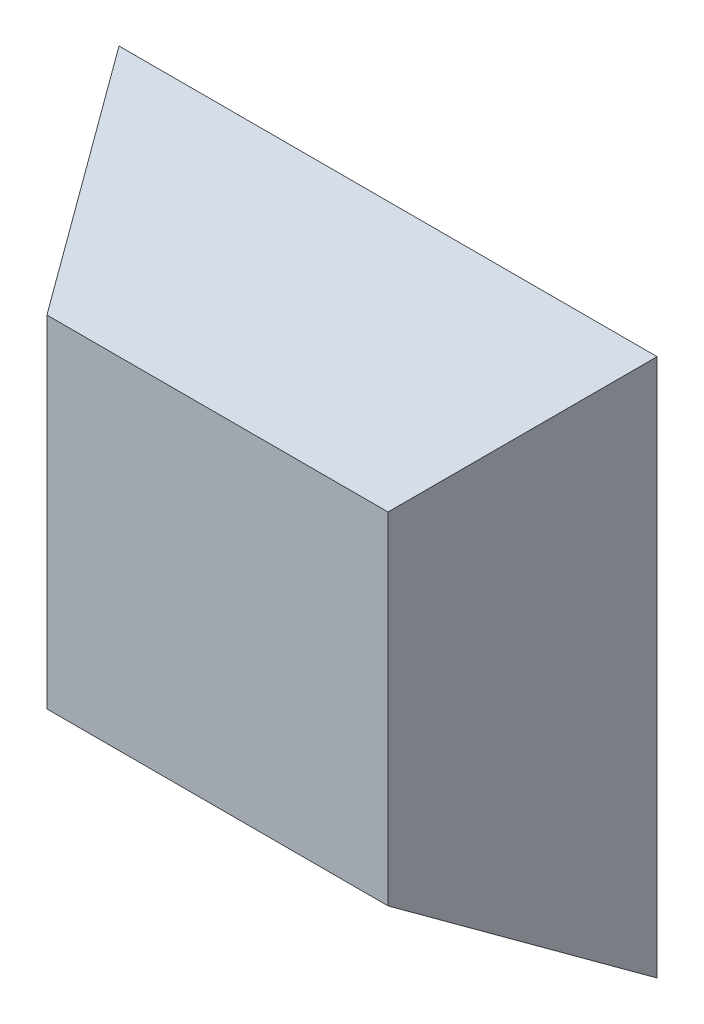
ISO-10303-21;
HEADER;
FILE_DESCRIPTION(('STEP AP214'),'2;1');
FILE_NAME('part.step','',(''),(''),'','','');
FILE_SCHEMA(('AUTOMOTIVE_DESIGN { 1 0 10303 214 1 1 1 1 }'));
ENDSEC;
DATA;
#1=APPLICATION_CONTEXT('core data for automotive mechanical design processes');
#2=APPLICATION_PROTOCOL_DEFINITION('international standard','automotive_design',2000,#1);
#3=PRODUCT_CONTEXT('',#1,'mechanical');
#4=PRODUCT('Part','Part','',(#3));
#5=PRODUCT_RELATED_PRODUCT_CATEGORY('part','',(#4));
#6=PRODUCT_DEFINITION_FORMATION('','',#4);
#7=PRODUCT_DEFINITION_CONTEXT('part definition',#1,'design');
#8=PRODUCT_DEFINITION('design','',#6,#7);
#9=PRODUCT_DEFINITION_SHAPE('','',#8);
#10=(LENGTH_UNIT() NAMED_UNIT(*) SI_UNIT(.MILLI.,.METRE.));
#11=(NAMED_UNIT(*) PLANE_ANGLE_UNIT() SI_UNIT($,.RADIAN.));
#12=(NAMED_UNIT(*) SI_UNIT($,.STERADIAN.) SOLID_ANGLE_UNIT());
#13=UNCERTAINTY_MEASURE_WITH_UNIT(LENGTH_MEASURE(1.E-05),#10,'distance_accuracy_value','');
#14=(GEOMETRIC_REPRESENTATION_CONTEXT(3) GLOBAL_UNCERTAINTY_ASSIGNED_CONTEXT((#13)) GLOBAL_UNIT_ASSIGNED_CONTEXT((#10,
#11,#12)) REPRESENTATION_CONTEXT('',''));
#15=CARTESIAN_POINT('',(0.,0.,0.));
#16=DIRECTION('',(0.,0.,1.));
#17=DIRECTION('',(1.,0.,0.));
#18=AXIS2_PLACEMENT_3D('',#15,#16,#17);
#19=CARTESIAN_POINT('',(-80.,80.,80.));
#20=DIRECTION('',(-0.866025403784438,0.,0.500000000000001));
#21=DIRECTION('',(0.500000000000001,0.,0.866025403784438));
#22=AXIS2_PLACEMENT_3D('',#19,#20,#21);
#23=PLANE('',#22);
#24=DIRECTION('',(0.,1.,0.));
#25=VECTOR('',#24,1.);
#26=CARTESIAN_POINT('',(-126.18802153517,80.,0.));
#27=LINE('',#26,#25);
#28=CARTESIAN_POINT('',(-126.18802153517,126.18802153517,0.));
#29=VERTEX_POINT('',#28);
#30=CARTESIAN_POINT('',(-126.18802153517,-126.18802153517,0.));
#31=VERTEX_POINT('',#30);
#32=EDGE_CURVE('E405',#29,#31,#27,.F.);
#33=ORIENTED_EDGE('',*,*,#32,.T.);
#34=DIRECTION('',(-0.447213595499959,-0.447213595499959,-0.774596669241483));
#35=VECTOR('',#34,1.);
#36=CARTESIAN_POINT('',(-80.,-80.,80.));
#37=LINE('',#36,#35);
#38=CARTESIAN_POINT('',(-80.,-80.,80.));
#39=VERTEX_POINT('',#38);
#40=EDGE_CURVE('E11',#39,#31,#37,.T.);
#41=ORIENTED_EDGE('',*,*,#40,.F.);
#42=DIRECTION('',(0.,-1.,0.));
#43=VECTOR('',#42,1.);
#44=CARTESIAN_POINT('',(-80.,80.,80.));
#45=LINE('',#44,#43);
#46=CARTESIAN_POINT('',(-80.,80.,80.));
#47=VERTEX_POINT('',#46);
#48=EDGE_CURVE('E416',#47,#39,#45,.T.);
#49=ORIENTED_EDGE('',*,*,#48,.F.);
#50=DIRECTION('',(-0.447213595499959,0.447213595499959,-0.774596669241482));
#51=VECTOR('',#50,1.);
#52=CARTESIAN_POINT('',(-80.,80.,80.));
#53=LINE('',#52,#51);
#54=EDGE_CURVE('E425',#47,#29,#53,.T.);
#55=ORIENTED_EDGE('',*,*,#54,.T.);
#56=EDGE_LOOP('',(#33,#41,#49,#55));
#57=FACE_BOUND('',#56,.T.);
#58=ADVANCED_FACE('F349',(#57),#23,.T.);
#59=CARTESIAN_POINT('',(-80.,-80.,80.));
#60=DIRECTION('',(0.,-0.866025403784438,0.500000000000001));
#61=DIRECTION('',(0.,-0.500000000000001,-0.866025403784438));
#62=AXIS2_PLACEMENT_3D('',#59,#60,#61);
#63=PLANE('',#62);
#64=DIRECTION('',(-1.,0.,0.));
#65=VECTOR('',#64,1.);
#66=CARTESIAN_POINT('',(-80.,-126.18802153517,0.));
#67=LINE('',#66,#65);
#68=CARTESIAN_POINT('',(126.18802153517,-126.18802153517,0.));
#69=VERTEX_POINT('',#68);
#70=EDGE_CURVE('E395',#31,#69,#67,.F.);
#71=ORIENTED_EDGE('',*,*,#70,.T.);
#72=DIRECTION('',(0.447213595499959,-0.447213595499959,-0.774596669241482));
#73=VECTOR('',#72,1.);
#74=CARTESIAN_POINT('',(47.9999999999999,-47.9999999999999,135.425625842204));
#75=LINE('',#74,#73);
#76=CARTESIAN_POINT('',(80.,-80.,80.));
#77=VERTEX_POINT('',#76);
#78=EDGE_CURVE('E358',#77,#69,#75,.T.);
#79=ORIENTED_EDGE('',*,*,#78,.F.);
#80=DIRECTION('',(1.,0.,0.));
#81=VECTOR('',#80,1.);
#82=CARTESIAN_POINT('',(-80.,-80.,80.));
#83=LINE('',#82,#81);
#84=EDGE_CURVE('E419',#39,#77,#83,.T.);
#85=ORIENTED_EDGE('',*,*,#84,.F.);
#86=ORIENTED_EDGE('',*,*,#40,.T.);
#87=EDGE_LOOP('',(#71,#79,#85,#86));
#88=FACE_BOUND('',#87,.T.);
#89=ADVANCED_FACE('F397',(#88),#63,.T.);
#90=CARTESIAN_POINT('',(80.,80.,80.));
#91=DIRECTION('',(0.866025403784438,0.,0.500000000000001));
#92=DIRECTION('',(0.500000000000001,0.,-0.866025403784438));
#93=AXIS2_PLACEMENT_3D('',#90,#91,#92);
#94=PLANE('',#93);
#95=DIRECTION('',(0.,-1.,0.));
#96=VECTOR('',#95,1.);
#97=CARTESIAN_POINT('',(126.18802153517,80.,0.));
#98=LINE('',#97,#96);
#99=CARTESIAN_POINT('',(126.18802153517,126.18802153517,0.));
#100=VERTEX_POINT('',#99);
#101=EDGE_CURVE('E353',#69,#100,#98,.F.);
#102=ORIENTED_EDGE('',*,*,#101,.T.);
#103=DIRECTION('',(0.447213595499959,0.447213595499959,-0.774596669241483));
#104=VECTOR('',#103,1.);
#105=CARTESIAN_POINT('',(47.9999999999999,47.9999999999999,135.425625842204));
#106=LINE('',#105,#104);
#107=CARTESIAN_POINT('',(80.,80.,80.));
#108=VERTEX_POINT('',#107);
#109=EDGE_CURVE('E411',#108,#100,#106,.T.);
#110=ORIENTED_EDGE('',*,*,#109,.F.);
#111=DIRECTION('',(0.,1.,0.));
#112=VECTOR('',#111,1.);
#113=CARTESIAN_POINT('',(80.,80.,80.));
#114=LINE('',#113,#112);
#115=EDGE_CURVE('E410',#77,#108,#114,.T.);
#116=ORIENTED_EDGE('',*,*,#115,.F.);
#117=ORIENTED_EDGE('',*,*,#78,.T.);
#118=EDGE_LOOP('',(#102,#110,#116,#117));
#119=FACE_BOUND('',#118,.T.);
#120=ADVANCED_FACE('F351',(#119),#94,.T.);
#121=CARTESIAN_POINT('',(-80.,80.,80.));
#122=DIRECTION('',(0.,0.866025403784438,0.500000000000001));
#123=DIRECTION('',(0.,-0.500000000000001,0.866025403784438));
#124=AXIS2_PLACEMENT_3D('',#121,#122,#123);
#125=PLANE('',#124);
#126=DIRECTION('',(1.,0.,0.));
#127=VECTOR('',#126,1.);
#128=CARTESIAN_POINT('',(-80.,126.18802153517,0.));
#129=LINE('',#128,#127);
#130=EDGE_CURVE('E415',#100,#29,#129,.F.);
#131=ORIENTED_EDGE('',*,*,#130,.T.);
#132=ORIENTED_EDGE('',*,*,#54,.F.);
#133=DIRECTION('',(-1.,0.,0.));
#134=VECTOR('',#133,1.);
#135=CARTESIAN_POINT('',(-80.,80.,80.));
#136=LINE('',#135,#134);
#137=EDGE_CURVE('E375',#108,#47,#136,.T.);
#138=ORIENTED_EDGE('',*,*,#137,.F.);
#139=ORIENTED_EDGE('',*,*,#109,.T.);
#140=EDGE_LOOP('',(#131,#132,#138,#139));
#141=FACE_BOUND('',#140,.T.);
#142=ADVANCED_FACE('F488',(#141),#125,.T.);
#143=CARTESIAN_POINT('',(-80.,-80.,80.));
#144=DIRECTION('',(0.,0.,1.));
#145=DIRECTION('',(1.,0.,0.));
#146=AXIS2_PLACEMENT_3D('',#143,#144,#145);
#147=PLANE('',#146);
#148=ORIENTED_EDGE('',*,*,#48,.T.);
#149=ORIENTED_EDGE('',*,*,#84,.T.);
#150=ORIENTED_EDGE('',*,*,#115,.T.);
#151=ORIENTED_EDGE('',*,*,#137,.T.);
#152=EDGE_LOOP('',(#148,#149,#150,#151));
#153=FACE_BOUND('',#152,.T.);
#154=ADVANCED_FACE('F485',(#153),#147,.T.);
#155=CARTESIAN_POINT('',(-80.,-80.,0.));
#156=DIRECTION('',(0.,0.,1.));
#157=DIRECTION('',(1.,0.,0.));
#158=AXIS2_PLACEMENT_3D('',#155,#156,#157);
#159=PLANE('',#158);
#160=DIRECTION('',(1.,0.,0.));
#161=VECTOR('',#160,1.);
#162=CARTESIAN_POINT('',(-80.,124.455970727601,0.));
#163=LINE('',#162,#161);
#164=CARTESIAN_POINT('',(124.455970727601,124.455970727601,0.));
#165=VERTEX_POINT('',#164);
#166=CARTESIAN_POINT('',(-124.455970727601,124.455970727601,0.));
#167=VERTEX_POINT('',#166);
#168=EDGE_CURVE('E436',#165,#167,#163,.F.);
#169=ORIENTED_EDGE('',*,*,#168,.T.);
#170=DIRECTION('',(0.,1.,0.));
#171=VECTOR('',#170,1.);
#172=CARTESIAN_POINT('',(-124.455970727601,80.,0.));
#173=LINE('',#172,#171);
#174=CARTESIAN_POINT('',(-124.455970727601,-124.455970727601,0.));
#175=VERTEX_POINT('',#174);
#176=EDGE_CURVE('E434',#167,#175,#173,.F.);
#177=ORIENTED_EDGE('',*,*,#176,.T.);
#178=DIRECTION('',(-1.,0.,0.));
#179=VECTOR('',#178,1.);
#180=CARTESIAN_POINT('',(-80.,-124.455970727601,0.));
#181=LINE('',#180,#179);
#182=CARTESIAN_POINT('',(124.455970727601,-124.455970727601,0.));
#183=VERTEX_POINT('',#182);
#184=EDGE_CURVE('E431',#175,#183,#181,.F.);
#185=ORIENTED_EDGE('',*,*,#184,.T.);
#186=DIRECTION('',(0.,-1.,0.));
#187=VECTOR('',#186,1.);
#188=CARTESIAN_POINT('',(124.455970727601,80.,0.));
#189=LINE('',#188,#187);
#190=EDGE_CURVE('E366',#183,#165,#189,.F.);
#191=ORIENTED_EDGE('',*,*,#190,.T.);
#192=EDGE_LOOP('',(#169,#177,#185,#191));
#193=FACE_BOUND('',#192,.T.);
#194=ORIENTED_EDGE('',*,*,#32,.F.);
#195=ORIENTED_EDGE('',*,*,#130,.F.);
#196=ORIENTED_EDGE('',*,*,#101,.F.);
#197=ORIENTED_EDGE('',*,*,#70,.F.);
#198=EDGE_LOOP('',(#194,#195,#196,#197));
#199=FACE_BOUND('',#198,.T.);
#200=ADVANCED_FACE('F414',(#193,#199),#159,.F.);
#201=CARTESIAN_POINT('',(-78.7009618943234,80.,79.25));
#202=DIRECTION('',(-0.866025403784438,0.,0.500000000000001));
#203=DIRECTION('',(0.500000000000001,0.,0.866025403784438));
#204=AXIS2_PLACEMENT_3D('',#201,#202,#203);
#205=PLANE('',#204);
#206=ORIENTED_EDGE('',*,*,#176,.F.);
#207=DIRECTION('',(-0.447213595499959,0.447213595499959,-0.774596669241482));
#208=VECTOR('',#207,1.);
#209=CARTESIAN_POINT('',(-78.9607695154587,78.9607695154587,78.8));
#210=LINE('',#209,#208);
#211=CARTESIAN_POINT('',(-79.1339745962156,79.1339745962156,78.5));
#212=VERTEX_POINT('',#211);
#213=EDGE_CURVE('E445',#212,#167,#210,.T.);
#214=ORIENTED_EDGE('',*,*,#213,.F.);
#215=DIRECTION('',(0.,1.,0.));
#216=VECTOR('',#215,1.);
#217=CARTESIAN_POINT('',(-79.1339745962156,80.,78.5));
#218=LINE('',#217,#216);
#219=CARTESIAN_POINT('',(-79.1339745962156,-79.1339745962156,78.5));
#220=VERTEX_POINT('',#219);
#221=EDGE_CURVE('E439',#212,#220,#218,.F.);
#222=ORIENTED_EDGE('',*,*,#221,.T.);
#223=DIRECTION('',(-0.447213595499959,-0.447213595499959,-0.774596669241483));
#224=VECTOR('',#223,1.);
#225=CARTESIAN_POINT('',(-78.9607695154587,-78.9607695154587,78.8));
#226=LINE('',#225,#224);
#227=EDGE_CURVE('E422',#220,#175,#226,.T.);
#228=ORIENTED_EDGE('',*,*,#227,.T.);
#229=EDGE_LOOP('',(#206,#214,#222,#228));
#230=FACE_BOUND('',#229,.T.);
#231=ADVANCED_FACE('F465',(#230),#205,.F.);
#232=CARTESIAN_POINT('',(-80.,-78.7009618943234,79.25));
#233=DIRECTION('',(0.,-0.866025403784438,0.500000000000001));
#234=DIRECTION('',(0.,-0.500000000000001,-0.866025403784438));
#235=AXIS2_PLACEMENT_3D('',#232,#233,#234);
#236=PLANE('',#235);
#237=ORIENTED_EDGE('',*,*,#184,.F.);
#238=ORIENTED_EDGE('',*,*,#227,.F.);
#239=DIRECTION('',(-1.,0.,0.));
#240=VECTOR('',#239,1.);
#241=CARTESIAN_POINT('',(-80.,-79.1339745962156,78.5));
#242=LINE('',#241,#240);
#243=CARTESIAN_POINT('',(79.1339745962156,-79.1339745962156,78.5));
#244=VERTEX_POINT('',#243);
#245=EDGE_CURVE('E449',#220,#244,#242,.F.);
#246=ORIENTED_EDGE('',*,*,#245,.T.);
#247=DIRECTION('',(0.447213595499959,-0.447213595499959,-0.774596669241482));
#248=VECTOR('',#247,1.);
#249=CARTESIAN_POINT('',(46.9607695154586,-46.9607695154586,134.225625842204));
#250=LINE('',#249,#248);
#251=EDGE_CURVE('E452',#244,#183,#250,.T.);
#252=ORIENTED_EDGE('',*,*,#251,.T.);
#253=EDGE_LOOP('',(#237,#238,#246,#252));
#254=FACE_BOUND('',#253,.T.);
#255=ADVANCED_FACE('F513',(#254),#236,.F.);
#256=CARTESIAN_POINT('',(78.7009618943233,80.,79.25));
#257=DIRECTION('',(0.866025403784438,0.,0.500000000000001));
#258=DIRECTION('',(0.500000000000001,0.,-0.866025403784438));
#259=AXIS2_PLACEMENT_3D('',#256,#257,#258);
#260=PLANE('',#259);
#261=ORIENTED_EDGE('',*,*,#190,.F.);
#262=ORIENTED_EDGE('',*,*,#251,.F.);
#263=DIRECTION('',(0.,-1.,0.));
#264=VECTOR('',#263,1.);
#265=CARTESIAN_POINT('',(79.1339745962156,80.,78.5));
#266=LINE('',#265,#264);
#267=CARTESIAN_POINT('',(79.1339745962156,79.1339745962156,78.5));
#268=VERTEX_POINT('',#267);
#269=EDGE_CURVE('E446',#244,#268,#266,.F.);
#270=ORIENTED_EDGE('',*,*,#269,.T.);
#271=DIRECTION('',(0.447213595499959,0.447213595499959,-0.774596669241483));
#272=VECTOR('',#271,1.);
#273=CARTESIAN_POINT('',(46.9607695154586,46.9607695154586,134.225625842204));
#274=LINE('',#273,#272);
#275=EDGE_CURVE('E450',#268,#165,#274,.T.);
#276=ORIENTED_EDGE('',*,*,#275,.T.);
#277=EDGE_LOOP('',(#261,#262,#270,#276));
#278=FACE_BOUND('',#277,.T.);
#279=ADVANCED_FACE('F510',(#278),#260,.F.);
#280=CARTESIAN_POINT('',(-80.,78.7009618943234,79.25));
#281=DIRECTION('',(0.,0.866025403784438,0.500000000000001));
#282=DIRECTION('',(0.,-0.500000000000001,0.866025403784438));
#283=AXIS2_PLACEMENT_3D('',#280,#281,#282);
#284=PLANE('',#283);
#285=ORIENTED_EDGE('',*,*,#168,.F.);
#286=ORIENTED_EDGE('',*,*,#275,.F.);
#287=DIRECTION('',(1.,0.,0.));
#288=VECTOR('',#287,1.);
#289=CARTESIAN_POINT('',(-80.,79.1339745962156,78.5));
#290=LINE('',#289,#288);
#291=EDGE_CURVE('E442',#268,#212,#290,.F.);
#292=ORIENTED_EDGE('',*,*,#291,.T.);
#293=ORIENTED_EDGE('',*,*,#213,.T.);
#294=EDGE_LOOP('',(#285,#286,#292,#293));
#295=FACE_BOUND('',#294,.T.);
#296=ADVANCED_FACE('F479',(#295),#284,.F.);
#297=CARTESIAN_POINT('',(-80.,-80.,78.5));
#298=DIRECTION('',(0.,0.,1.));
#299=DIRECTION('',(1.,0.,0.));
#300=AXIS2_PLACEMENT_3D('',#297,#298,#299);
#301=PLANE('',#300);
#302=ORIENTED_EDGE('',*,*,#221,.F.);
#303=ORIENTED_EDGE('',*,*,#291,.F.);
#304=ORIENTED_EDGE('',*,*,#269,.F.);
#305=ORIENTED_EDGE('',*,*,#245,.F.);
#306=EDGE_LOOP('',(#302,#303,#304,#305));
#307=FACE_BOUND('',#306,.T.);
#308=ADVANCED_FACE('F504',(#307),#301,.F.);
#309=CLOSED_SHELL('',(#58,#89,#120,#142,#154,#200,#231,#255,#279,#296,#308));
#310=MANIFOLD_SOLID_BREP('B2',#309);
#311=ADVANCED_BREP_SHAPE_REPRESENTATION('',(#18,#310),#14);
#312=SHAPE_DEFINITION_REPRESENTATION(#9,#311);
ENDSEC;
END-ISO-10303-21;
